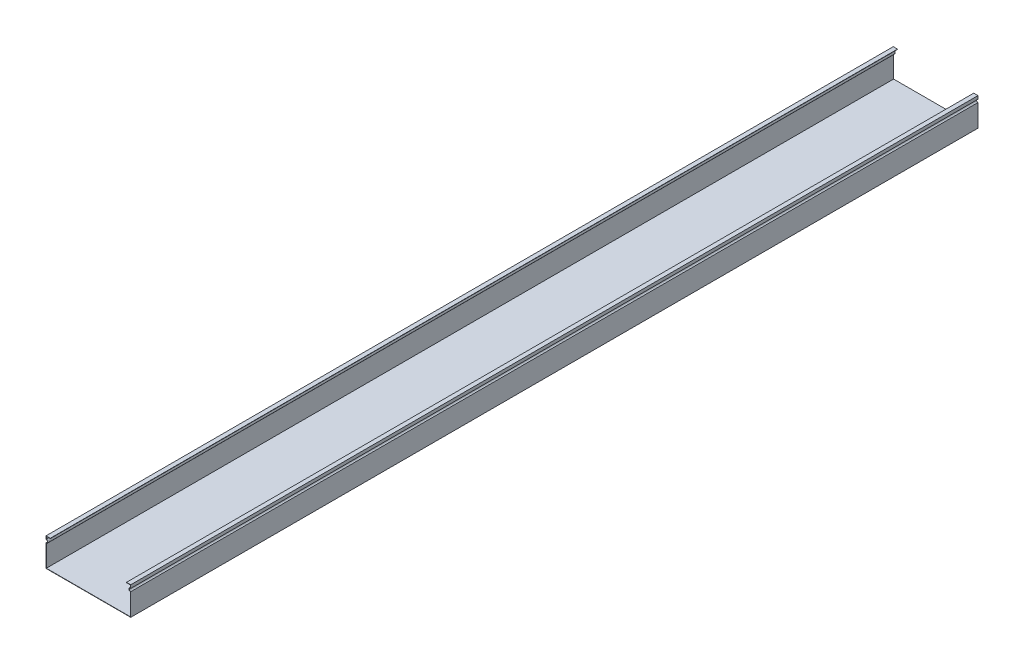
from build123d import *

# Parameters (mm, degrees)
EXTRUDE1_DEPTH = 3000


with BuildPart() as part:
    # Sketch2 → Extrude1 (new body)
    with BuildSketch(Plane.XY):
        with BuildLine():
            Line((-15, 0), (-15, -11.21412))
            ThreePointArc((-15, -11.21412), (-10, -16.21412), (-15, -21.21412))
            Line((-15, -21.21412), (-15, -100))
            Line((-15, -100), (285, -100))
            Line((285, -100), (285, -21.21412))
            ThreePointArc((285, -21.21412), (280, -16.21412), (285, -11.21412))
            Line((285, -11.21412), (285, 0))
            Line((285, 0), (270, 0))
            Line((270, 0), (270, -1.21412))
            Line((270, -1.21412), (283.78588, -1.21412))
            Line((283.78588, -1.21412), (283.78588, -10.119761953))
            ThreePointArc((283.78588, -10.119761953), (278.78588, -16.21412), (283.78588, -22.308478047))
            Line((283.78588, -22.308478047), (283.78588, -98.78588))
            Line((283.78588, -98.78588), (-13.78588, -98.78588))
            Line((-13.78588, -98.78588), (-13.78588, -22.308478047))
            ThreePointArc((-13.78588, -22.308478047), (-8.78588, -16.21412), (-13.78588, -10.119761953))
            Line((-13.78588, -10.119761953), (-13.78588, -1.21412))
            Line((-13.78588, -1.21412), (0, -1.21412))
            Line((0, -1.21412), (0, 0))
            Line((0, 0), (-15, 0))
        make_face()
    extrude(amount=EXTRUDE1_DEPTH)


solid = part.part
